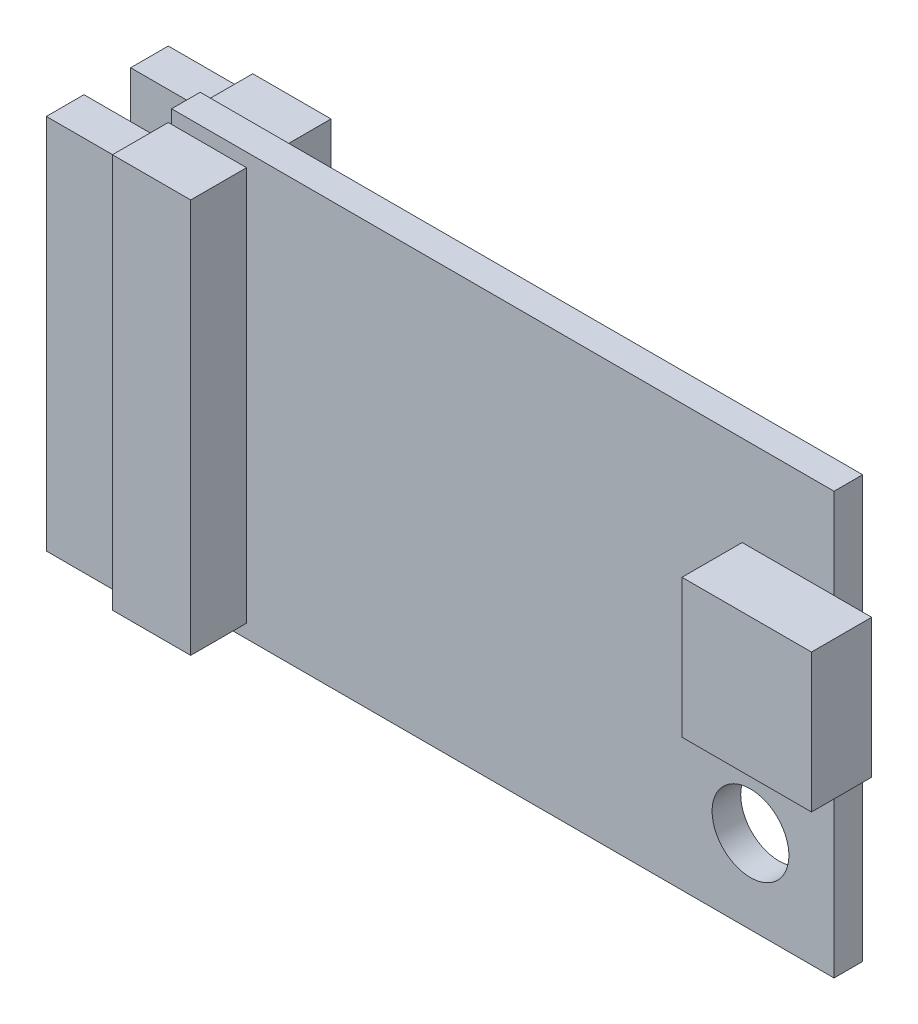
from build123d import *

# Parameters (mm, degrees)
SKETCH1_W           = 22
SKETCH1_H           = 14
SKETCH1_R           = 1.275
BOSS_EXTRUDE1_DEPTH = 0.475
SKETCH2_W           = 2.6
SKETCH2_H           = 13.1
BOSS_EXTRUDE2_DEPTH = 1.855
SKETCH3_W           = 1.25
SKETCH3_H           = 12.5
BOSS_EXTRUDE3_DEPTH = 2.5
SKETCH4_W           = 4.3
SKETCH4_H           = 4.6
BOSS_EXTRUDE4_DEPTH = 2


with BuildPart() as part:
    # Sketch1 → Boss-Extrude1 (new, symmetric)
    with BuildSketch(Plane.XY):
        Rectangle(SKETCH1_W, SKETCH1_H)
        with Locations(Location((8.225, -4.225, 0), (0, 0, 180))):
            Circle(SKETCH1_R, mode=Mode.SUBTRACT)
    extrude(amount=BOSS_EXTRUDE1_DEPTH, both=True)

    # Sketch2 → Boss-Extrude2 (add)
    with BuildSketch(Plane.XY.offset(0.475)):
        with Locations((-9.81, 0)):
            Rectangle(SKETCH2_W, SKETCH2_H)
    boss_extrude2 = extrude(amount=BOSS_EXTRUDE2_DEPTH)

    # Mirror1: Boss-Extrude2 across plane
    add(boss_extrude2.mirror(Plane.XY))

    # Sketch3 → Boss-Extrude3 (add)
    with BuildSketch(Plane.ZY.offset(11.11)):
        with Locations((-1.4, 0)):
            Rectangle(SKETCH3_W, SKETCH3_H)
    boss_extrude3 = extrude(amount=BOSS_EXTRUDE3_DEPTH)

    # Mirror2: Boss-Extrude3 across plane
    add(boss_extrude3.mirror(Plane.XY))

    # Sketch4 → Boss-Extrude4 (add)
    with BuildSketch(Plane.XY.offset(0.475)):
        with Locations((10.1, 1.7)):
            Rectangle(SKETCH4_W, SKETCH4_H)
    extrude(amount=BOSS_EXTRUDE4_DEPTH)


solid = part.part
